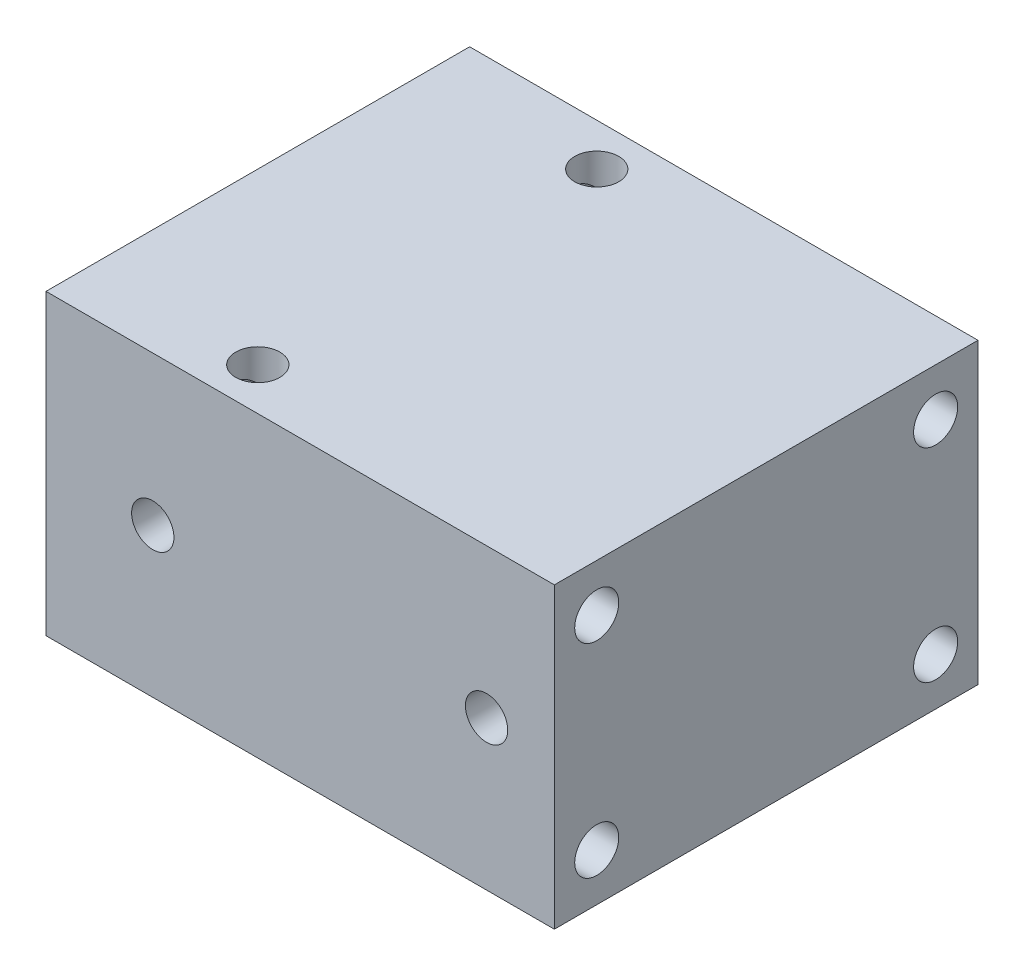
ISO-10303-21;
HEADER;
FILE_DESCRIPTION(('STEP AP214'),'2;1');
FILE_NAME('part.step','',(''),(''),'','','');
FILE_SCHEMA(('AUTOMOTIVE_DESIGN { 1 0 10303 214 1 1 1 1 }'));
ENDSEC;
DATA;
#1=APPLICATION_CONTEXT('core data for automotive mechanical design processes');
#2=APPLICATION_PROTOCOL_DEFINITION('international standard','automotive_design',2000,#1);
#3=PRODUCT_CONTEXT('',#1,'mechanical');
#4=PRODUCT('Part','Part','',(#3));
#5=PRODUCT_RELATED_PRODUCT_CATEGORY('part','',(#4));
#6=PRODUCT_DEFINITION_FORMATION('','',#4);
#7=PRODUCT_DEFINITION_CONTEXT('part definition',#1,'design');
#8=PRODUCT_DEFINITION('design','',#6,#7);
#9=PRODUCT_DEFINITION_SHAPE('','',#8);
#10=(LENGTH_UNIT() NAMED_UNIT(*) SI_UNIT(.MILLI.,.METRE.));
#11=(NAMED_UNIT(*) PLANE_ANGLE_UNIT() SI_UNIT($,.RADIAN.));
#12=(NAMED_UNIT(*) SI_UNIT($,.STERADIAN.) SOLID_ANGLE_UNIT());
#13=UNCERTAINTY_MEASURE_WITH_UNIT(LENGTH_MEASURE(1.E-05),#10,'distance_accuracy_value','');
#14=(GEOMETRIC_REPRESENTATION_CONTEXT(3) GLOBAL_UNCERTAINTY_ASSIGNED_CONTEXT((#13)) GLOBAL_UNIT_ASSIGNED_CONTEXT((#10,
#11,#12)) REPRESENTATION_CONTEXT('',''));
#15=CARTESIAN_POINT('',(0.,0.,0.));
#16=DIRECTION('',(0.,0.,1.));
#17=DIRECTION('',(1.,0.,0.));
#18=AXIS2_PLACEMENT_3D('',#15,#16,#17);
#19=CARTESIAN_POINT('',(-25.,88.,50.));
#20=DIRECTION('',(0.,-1.,0.));
#21=DIRECTION('',(0.,0.,-1.));
#22=AXIS2_PLACEMENT_3D('',#19,#20,#21);
#23=CYLINDRICAL_SURFACE('',#22,6.5);
#24=CARTESIAN_POINT('',(-25.,14.,50.));
#25=DIRECTION('',(-0.707106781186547,-0.707106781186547,0.));
#26=DIRECTION('',(0.707106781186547,-0.707106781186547,0.));
#27=AXIS2_PLACEMENT_3D('',#24,#25,#26);
#28=ELLIPSE('',#27,9.19238815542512,6.5);
#29=CARTESIAN_POINT('',(-25.,14.,43.5));
#30=VERTEX_POINT('',#29);
#31=CARTESIAN_POINT('',(-25.,14.,56.5));
#32=VERTEX_POINT('',#31);
#33=EDGE_CURVE('E11',#30,#32,#28,.F.);
#34=ORIENTED_EDGE('',*,*,#33,.F.);
#35=CARTESIAN_POINT('',(-25.,14.,50.));
#36=DIRECTION('',(0.707106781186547,-0.707106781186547,0.));
#37=DIRECTION('',(-0.707106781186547,-0.707106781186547,0.));
#38=AXIS2_PLACEMENT_3D('',#35,#36,#37);
#39=ELLIPSE('',#38,9.19238815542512,6.5);
#40=EDGE_CURVE('E51',#32,#30,#39,.F.);
#41=ORIENTED_EDGE('',*,*,#40,.F.);
#42=EDGE_LOOP('',(#34,#41));
#43=FACE_BOUND('',#42,.T.);
#44=CARTESIAN_POINT('',(-25.,74.,50.));
#45=DIRECTION('',(-0.707106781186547,-0.707106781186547,0.));
#46=DIRECTION('',(0.707106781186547,-0.707106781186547,0.));
#47=AXIS2_PLACEMENT_3D('',#44,#45,#46);
#48=ELLIPSE('',#47,9.19238815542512,6.5);
#49=CARTESIAN_POINT('',(-25.,74.,43.5));
#50=VERTEX_POINT('',#49);
#51=CARTESIAN_POINT('',(-25.,74.,56.5));
#52=VERTEX_POINT('',#51);
#53=EDGE_CURVE('E265',#50,#52,#48,.T.);
#54=ORIENTED_EDGE('',*,*,#53,.F.);
#55=CARTESIAN_POINT('',(-25.,74.,50.));
#56=DIRECTION('',(0.707106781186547,-0.707106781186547,0.));
#57=DIRECTION('',(-0.707106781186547,-0.707106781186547,0.));
#58=AXIS2_PLACEMENT_3D('',#55,#56,#57);
#59=ELLIPSE('',#58,9.19238815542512,6.5);
#60=EDGE_CURVE('E263',#52,#50,#59,.T.);
#61=ORIENTED_EDGE('',*,*,#60,.F.);
#62=EDGE_LOOP('',(#54,#61));
#63=FACE_BOUND('',#62,.T.);
#64=ADVANCED_FACE('F35',(#43,#63),#23,.F.);
#65=CARTESIAN_POINT('',(-25.,74.,50.));
#66=DIRECTION('',(-0.707106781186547,-0.707106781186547,0.));
#67=DIRECTION('',(0.707106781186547,-0.707106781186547,0.));
#68=AXIS2_PLACEMENT_3D('',#65,#66,#67);
#69=ELLIPSE('',#68,9.19238815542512,6.5);
#70=EDGE_CURVE('E118',#50,#52,#69,.F.);
#71=ORIENTED_EDGE('',*,*,#70,.F.);
#72=CARTESIAN_POINT('',(-25.,74.,50.));
#73=DIRECTION('',(0.707106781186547,-0.707106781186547,0.));
#74=DIRECTION('',(-0.707106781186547,-0.707106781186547,0.));
#75=AXIS2_PLACEMENT_3D('',#72,#73,#74);
#76=ELLIPSE('',#75,9.19238815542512,6.5);
#77=EDGE_CURVE('E58',#52,#50,#76,.F.);
#78=ORIENTED_EDGE('',*,*,#77,.F.);
#79=EDGE_LOOP('',(#71,#78));
#80=FACE_BOUND('',#79,.T.);
#81=CARTESIAN_POINT('',(-25.,88.,50.));
#82=DIRECTION('',(0.,1.,0.));
#83=DIRECTION('',(0.,0.,1.));
#84=AXIS2_PLACEMENT_3D('',#81,#82,#83);
#85=CIRCLE('',#84,6.5);
#86=CARTESIAN_POINT('',(-25.,88.,56.5));
#87=VERTEX_POINT('',#86);
#88=EDGE_CURVE('E199',#87,#87,#85,.T.);
#89=ORIENTED_EDGE('',*,*,#88,.T.);
#90=EDGE_LOOP('',(#89));
#91=FACE_BOUND('',#90,.T.);
#92=ADVANCED_FACE('F320',(#80,#91),#23,.F.);
#93=CARTESIAN_POINT('',(-25.,88.,-50.));
#94=DIRECTION('',(0.,-1.,0.));
#95=DIRECTION('',(0.,0.,-1.));
#96=AXIS2_PLACEMENT_3D('',#93,#94,#95);
#97=CYLINDRICAL_SURFACE('',#96,6.5);
#98=CARTESIAN_POINT('',(-25.,14.,-50.));
#99=DIRECTION('',(-0.707106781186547,-0.707106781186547,0.));
#100=DIRECTION('',(0.707106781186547,-0.707106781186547,0.));
#101=AXIS2_PLACEMENT_3D('',#98,#99,#100);
#102=ELLIPSE('',#101,9.19238815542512,6.5);
#103=CARTESIAN_POINT('',(-25.,14.,-56.5));
#104=VERTEX_POINT('',#103);
#105=CARTESIAN_POINT('',(-25.,14.,-43.5));
#106=VERTEX_POINT('',#105);
#107=EDGE_CURVE('E259',#104,#106,#102,.F.);
#108=ORIENTED_EDGE('',*,*,#107,.F.);
#109=CARTESIAN_POINT('',(-25.,14.,-50.));
#110=DIRECTION('',(0.707106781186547,-0.707106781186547,0.));
#111=DIRECTION('',(-0.707106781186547,-0.707106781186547,0.));
#112=AXIS2_PLACEMENT_3D('',#109,#110,#111);
#113=ELLIPSE('',#112,9.19238815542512,6.5);
#114=EDGE_CURVE('E251',#106,#104,#113,.F.);
#115=ORIENTED_EDGE('',*,*,#114,.F.);
#116=EDGE_LOOP('',(#108,#115));
#117=FACE_BOUND('',#116,.T.);
#118=CARTESIAN_POINT('',(-25.,74.,-50.));
#119=DIRECTION('',(-0.707106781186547,-0.707106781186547,0.));
#120=DIRECTION('',(0.707106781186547,-0.707106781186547,0.));
#121=AXIS2_PLACEMENT_3D('',#118,#119,#120);
#122=ELLIPSE('',#121,9.19238815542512,6.5);
#123=CARTESIAN_POINT('',(-25.,74.,-56.5));
#124=VERTEX_POINT('',#123);
#125=CARTESIAN_POINT('',(-25.,74.,-43.5));
#126=VERTEX_POINT('',#125);
#127=EDGE_CURVE('E245',#124,#126,#122,.T.);
#128=ORIENTED_EDGE('',*,*,#127,.F.);
#129=CARTESIAN_POINT('',(-25.,74.,-50.));
#130=DIRECTION('',(0.707106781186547,-0.707106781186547,0.));
#131=DIRECTION('',(-0.707106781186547,-0.707106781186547,0.));
#132=AXIS2_PLACEMENT_3D('',#129,#130,#131);
#133=ELLIPSE('',#132,9.19238815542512,6.5);
#134=EDGE_CURVE('E243',#126,#124,#133,.T.);
#135=ORIENTED_EDGE('',*,*,#134,.F.);
#136=EDGE_LOOP('',(#128,#135));
#137=FACE_BOUND('',#136,.T.);
#138=ADVANCED_FACE('F325',(#117,#137),#97,.F.);
#139=CARTESIAN_POINT('',(-25.,74.,-50.));
#140=DIRECTION('',(-0.707106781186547,-0.707106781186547,0.));
#141=DIRECTION('',(0.707106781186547,-0.707106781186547,0.));
#142=AXIS2_PLACEMENT_3D('',#139,#140,#141);
#143=ELLIPSE('',#142,9.19238815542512,6.5);
#144=EDGE_CURVE('E248',#124,#126,#143,.F.);
#145=ORIENTED_EDGE('',*,*,#144,.F.);
#146=CARTESIAN_POINT('',(-25.,74.,-50.));
#147=DIRECTION('',(0.707106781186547,-0.707106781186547,0.));
#148=DIRECTION('',(-0.707106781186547,-0.707106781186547,0.));
#149=AXIS2_PLACEMENT_3D('',#146,#147,#148);
#150=ELLIPSE('',#149,9.19238815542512,6.5);
#151=EDGE_CURVE('E240',#126,#124,#150,.F.);
#152=ORIENTED_EDGE('',*,*,#151,.F.);
#153=EDGE_LOOP('',(#145,#152));
#154=FACE_BOUND('',#153,.T.);
#155=CARTESIAN_POINT('',(-25.,88.,-50.));
#156=DIRECTION('',(0.,1.,0.));
#157=DIRECTION('',(0.,0.,1.));
#158=AXIS2_PLACEMENT_3D('',#155,#156,#157);
#159=CIRCLE('',#158,6.5);
#160=CARTESIAN_POINT('',(-25.,88.,-43.5));
#161=VERTEX_POINT('',#160);
#162=EDGE_CURVE('E205',#161,#161,#159,.T.);
#163=ORIENTED_EDGE('',*,*,#162,.T.);
#164=EDGE_LOOP('',(#163));
#165=FACE_BOUND('',#164,.T.);
#166=ADVANCED_FACE('F338',(#154,#165),#97,.F.);
#167=CARTESIAN_POINT('',(-75.,88.,62.5));
#168=DIRECTION('',(0.,1.,0.));
#169=DIRECTION('',(0.,0.,1.));
#170=AXIS2_PLACEMENT_3D('',#167,#168,#169);
#171=PLANE('',#170);
#172=ORIENTED_EDGE('',*,*,#162,.F.);
#173=EDGE_LOOP('',(#172));
#174=FACE_BOUND('',#173,.T.);
#175=DIRECTION('',(0.,0.,1.));
#176=VECTOR('',#175,1.);
#177=CARTESIAN_POINT('',(-75.,88.,-62.5));
#178=LINE('',#177,#176);
#179=CARTESIAN_POINT('',(-75.,88.,-62.5));
#180=VERTEX_POINT('',#179);
#181=CARTESIAN_POINT('',(-75.,88.,62.5));
#182=VERTEX_POINT('',#181);
#183=EDGE_CURVE('E211',#180,#182,#178,.T.);
#184=ORIENTED_EDGE('',*,*,#183,.T.);
#185=DIRECTION('',(1.,0.,0.));
#186=VECTOR('',#185,1.);
#187=CARTESIAN_POINT('',(-75.,88.,62.5));
#188=LINE('',#187,#186);
#189=CARTESIAN_POINT('',(75.,88.,62.5));
#190=VERTEX_POINT('',#189);
#191=EDGE_CURVE('E214',#182,#190,#188,.T.);
#192=ORIENTED_EDGE('',*,*,#191,.T.);
#193=DIRECTION('',(0.,0.,-1.));
#194=VECTOR('',#193,1.);
#195=CARTESIAN_POINT('',(75.,88.,-62.5));
#196=LINE('',#195,#194);
#197=CARTESIAN_POINT('',(75.,88.,-62.5));
#198=VERTEX_POINT('',#197);
#199=EDGE_CURVE('E217',#190,#198,#196,.T.);
#200=ORIENTED_EDGE('',*,*,#199,.T.);
#201=DIRECTION('',(-1.,0.,0.));
#202=VECTOR('',#201,1.);
#203=CARTESIAN_POINT('',(-75.,88.,-62.5));
#204=LINE('',#203,#202);
#205=EDGE_CURVE('E219',#198,#180,#204,.T.);
#206=ORIENTED_EDGE('',*,*,#205,.T.);
#207=EDGE_LOOP('',(#184,#192,#200,#206));
#208=FACE_BOUND('',#207,.T.);
#209=ORIENTED_EDGE('',*,*,#88,.F.);
#210=EDGE_LOOP('',(#209));
#211=FACE_BOUND('',#210,.T.);
#212=ADVANCED_FACE('F308',(#174,#208,#211),#171,.T.);
#213=CARTESIAN_POINT('',(-75.,0.,62.5));
#214=DIRECTION('',(0.,1.,0.));
#215=DIRECTION('',(0.,0.,1.));
#216=AXIS2_PLACEMENT_3D('',#213,#214,#215);
#217=PLANE('',#216);
#218=CARTESIAN_POINT('',(-25.,0.,-50.));
#219=DIRECTION('',(0.,1.,0.));
#220=DIRECTION('',(0.,0.,1.));
#221=AXIS2_PLACEMENT_3D('',#218,#219,#220);
#222=CIRCLE('',#221,6.5);
#223=CARTESIAN_POINT('',(-25.,0.,-43.5));
#224=VERTEX_POINT('',#223);
#225=EDGE_CURVE('E202',#224,#224,#222,.T.);
#226=ORIENTED_EDGE('',*,*,#225,.T.);
#227=EDGE_LOOP('',(#226));
#228=FACE_BOUND('',#227,.T.);
#229=DIRECTION('',(0.,0.,1.));
#230=VECTOR('',#229,1.);
#231=CARTESIAN_POINT('',(-75.,0.,-62.5));
#232=LINE('',#231,#230);
#233=CARTESIAN_POINT('',(-75.,0.,-62.5));
#234=VERTEX_POINT('',#233);
#235=CARTESIAN_POINT('',(-75.,0.,62.5));
#236=VERTEX_POINT('',#235);
#237=EDGE_CURVE('E208',#234,#236,#232,.T.);
#238=ORIENTED_EDGE('',*,*,#237,.F.);
#239=DIRECTION('',(-1.,0.,0.));
#240=VECTOR('',#239,1.);
#241=CARTESIAN_POINT('',(-75.,0.,-62.5));
#242=LINE('',#241,#240);
#243=CARTESIAN_POINT('',(75.,0.,-62.5));
#244=VERTEX_POINT('',#243);
#245=EDGE_CURVE('E215',#244,#234,#242,.T.);
#246=ORIENTED_EDGE('',*,*,#245,.F.);
#247=DIRECTION('',(0.,0.,-1.));
#248=VECTOR('',#247,1.);
#249=CARTESIAN_POINT('',(75.,0.,-62.5));
#250=LINE('',#249,#248);
#251=CARTESIAN_POINT('',(75.,0.,62.5));
#252=VERTEX_POINT('',#251);
#253=EDGE_CURVE('E226',#252,#244,#250,.T.);
#254=ORIENTED_EDGE('',*,*,#253,.F.);
#255=DIRECTION('',(1.,0.,0.));
#256=VECTOR('',#255,1.);
#257=CARTESIAN_POINT('',(-75.,0.,62.5));
#258=LINE('',#257,#256);
#259=EDGE_CURVE('E224',#236,#252,#258,.T.);
#260=ORIENTED_EDGE('',*,*,#259,.F.);
#261=EDGE_LOOP('',(#238,#246,#254,#260));
#262=FACE_BOUND('',#261,.T.);
#263=CARTESIAN_POINT('',(-25.,0.,50.));
#264=DIRECTION('',(0.,1.,0.));
#265=DIRECTION('',(0.,0.,1.));
#266=AXIS2_PLACEMENT_3D('',#263,#264,#265);
#267=CIRCLE('',#266,6.5);
#268=CARTESIAN_POINT('',(-25.,0.,56.5));
#269=VERTEX_POINT('',#268);
#270=EDGE_CURVE('E196',#269,#269,#267,.T.);
#271=ORIENTED_EDGE('',*,*,#270,.T.);
#272=EDGE_LOOP('',(#271));
#273=FACE_BOUND('',#272,.T.);
#274=ADVANCED_FACE('F302',(#228,#262,#273),#217,.F.);
#275=CARTESIAN_POINT('',(-75.,88.,-62.5));
#276=DIRECTION('',(1.,0.,0.));
#277=DIRECTION('',(0.,0.,-1.));
#278=AXIS2_PLACEMENT_3D('',#275,#276,#277);
#279=PLANE('',#278);
#280=CARTESIAN_POINT('',(-75.,14.,50.));
#281=DIRECTION('',(-1.,0.,0.));
#282=DIRECTION('',(0.,0.,1.));
#283=AXIS2_PLACEMENT_3D('',#280,#281,#282);
#284=CIRCLE('',#283,6.5);
#285=CARTESIAN_POINT('',(-75.,14.,56.5));
#286=VERTEX_POINT('',#285);
#287=EDGE_CURVE('E131',#286,#286,#284,.T.);
#288=ORIENTED_EDGE('',*,*,#287,.F.);
#289=EDGE_LOOP('',(#288));
#290=FACE_BOUND('',#289,.T.);
#291=CARTESIAN_POINT('',(-75.,74.,50.));
#292=DIRECTION('',(-1.,0.,0.));
#293=DIRECTION('',(0.,0.,1.));
#294=AXIS2_PLACEMENT_3D('',#291,#292,#293);
#295=CIRCLE('',#294,6.5);
#296=CARTESIAN_POINT('',(-75.,74.,56.5));
#297=VERTEX_POINT('',#296);
#298=EDGE_CURVE('E150',#297,#297,#295,.T.);
#299=ORIENTED_EDGE('',*,*,#298,.F.);
#300=EDGE_LOOP('',(#299));
#301=FACE_BOUND('',#300,.T.);
#302=CARTESIAN_POINT('',(-75.,14.,-50.));
#303=DIRECTION('',(-1.,0.,0.));
#304=DIRECTION('',(0.,0.,1.));
#305=AXIS2_PLACEMENT_3D('',#302,#303,#304);
#306=CIRCLE('',#305,6.5);
#307=CARTESIAN_POINT('',(-75.,14.,-43.5));
#308=VERTEX_POINT('',#307);
#309=EDGE_CURVE('E156',#308,#308,#306,.T.);
#310=ORIENTED_EDGE('',*,*,#309,.F.);
#311=EDGE_LOOP('',(#310));
#312=FACE_BOUND('',#311,.T.);
#313=CARTESIAN_POINT('',(-75.,74.,-50.));
#314=DIRECTION('',(-1.,0.,0.));
#315=DIRECTION('',(0.,0.,1.));
#316=AXIS2_PLACEMENT_3D('',#313,#314,#315);
#317=CIRCLE('',#316,6.5);
#318=CARTESIAN_POINT('',(-75.,74.,-43.5));
#319=VERTEX_POINT('',#318);
#320=EDGE_CURVE('E162',#319,#319,#317,.T.);
#321=ORIENTED_EDGE('',*,*,#320,.F.);
#322=EDGE_LOOP('',(#321));
#323=FACE_BOUND('',#322,.T.);
#324=CARTESIAN_POINT('',(-75.,44.,0.));
#325=DIRECTION('',(-1.,0.,0.));
#326=DIRECTION('',(0.,0.,1.));
#327=AXIS2_PLACEMENT_3D('',#324,#325,#326);
#328=CIRCLE('',#327,1.5);
#329=CARTESIAN_POINT('',(-75.,44.,1.5));
#330=VERTEX_POINT('',#329);
#331=EDGE_CURVE('E192',#330,#330,#328,.T.);
#332=ORIENTED_EDGE('',*,*,#331,.F.);
#333=EDGE_LOOP('',(#332));
#334=FACE_BOUND('',#333,.T.);
#335=ORIENTED_EDGE('',*,*,#237,.T.);
#336=DIRECTION('',(0.,-1.,0.));
#337=VECTOR('',#336,1.);
#338=CARTESIAN_POINT('',(-75.,88.,62.5));
#339=LINE('',#338,#337);
#340=EDGE_CURVE('E237',#182,#236,#339,.T.);
#341=ORIENTED_EDGE('',*,*,#340,.F.);
#342=ORIENTED_EDGE('',*,*,#183,.F.);
#343=DIRECTION('',(0.,-1.,0.));
#344=VECTOR('',#343,1.);
#345=CARTESIAN_POINT('',(-75.,88.,-62.5));
#346=LINE('',#345,#344);
#347=EDGE_CURVE('E221',#180,#234,#346,.T.);
#348=ORIENTED_EDGE('',*,*,#347,.T.);
#349=EDGE_LOOP('',(#335,#341,#342,#348));
#350=FACE_BOUND('',#349,.T.);
#351=ADVANCED_FACE('F37',(#290,#301,#312,#323,#334,#350),#279,.F.);
#352=CARTESIAN_POINT('',(-75.,88.,62.5));
#353=DIRECTION('',(0.,0.,-1.));
#354=DIRECTION('',(-1.,0.,0.));
#355=AXIS2_PLACEMENT_3D('',#352,#353,#354);
#356=PLANE('',#355);
#357=CARTESIAN_POINT('',(55.,44.,62.5));
#358=DIRECTION('',(0.,0.,1.));
#359=DIRECTION('',(1.,0.,0.));
#360=AXIS2_PLACEMENT_3D('',#357,#358,#359);
#361=CIRCLE('',#360,6.2436883);
#362=CARTESIAN_POINT('',(61.2436883,44.,62.5));
#363=VERTEX_POINT('',#362);
#364=EDGE_CURVE('E168',#363,#363,#361,.T.);
#365=ORIENTED_EDGE('',*,*,#364,.F.);
#366=EDGE_LOOP('',(#365));
#367=FACE_BOUND('',#366,.T.);
#368=CARTESIAN_POINT('',(-43.5,44.,62.5));
#369=DIRECTION('',(0.,0.,1.));
#370=DIRECTION('',(1.,0.,0.));
#371=AXIS2_PLACEMENT_3D('',#368,#369,#370);
#372=CIRCLE('',#371,6.2436883);
#373=CARTESIAN_POINT('',(-37.2563117,44.,62.5));
#374=VERTEX_POINT('',#373);
#375=EDGE_CURVE('E180',#374,#374,#372,.T.);
#376=ORIENTED_EDGE('',*,*,#375,.F.);
#377=EDGE_LOOP('',(#376));
#378=FACE_BOUND('',#377,.T.);
#379=ORIENTED_EDGE('',*,*,#259,.T.);
#380=DIRECTION('',(0.,-1.,0.));
#381=VECTOR('',#380,1.);
#382=CARTESIAN_POINT('',(75.,88.,62.5));
#383=LINE('',#382,#381);
#384=EDGE_CURVE('E234',#190,#252,#383,.T.);
#385=ORIENTED_EDGE('',*,*,#384,.F.);
#386=ORIENTED_EDGE('',*,*,#191,.F.);
#387=ORIENTED_EDGE('',*,*,#340,.T.);
#388=EDGE_LOOP('',(#379,#385,#386,#387));
#389=FACE_BOUND('',#388,.T.);
#390=ADVANCED_FACE('F285',(#367,#378,#389),#356,.F.);
#391=CARTESIAN_POINT('',(75.,88.,-62.5));
#392=DIRECTION('',(-1.,0.,0.));
#393=DIRECTION('',(0.,0.,1.));
#394=AXIS2_PLACEMENT_3D('',#391,#392,#393);
#395=PLANE('',#394);
#396=CARTESIAN_POINT('',(75.,14.,50.));
#397=DIRECTION('',(-1.,0.,0.));
#398=DIRECTION('',(0.,0.,1.));
#399=AXIS2_PLACEMENT_3D('',#396,#397,#398);
#400=CIRCLE('',#399,6.5);
#401=CARTESIAN_POINT('',(75.,14.,56.5));
#402=VERTEX_POINT('',#401);
#403=EDGE_CURVE('E147',#402,#402,#400,.F.);
#404=ORIENTED_EDGE('',*,*,#403,.F.);
#405=EDGE_LOOP('',(#404));
#406=FACE_BOUND('',#405,.T.);
#407=CARTESIAN_POINT('',(75.,74.,50.));
#408=DIRECTION('',(-1.,0.,0.));
#409=DIRECTION('',(0.,0.,1.));
#410=AXIS2_PLACEMENT_3D('',#407,#408,#409);
#411=CIRCLE('',#410,6.5);
#412=CARTESIAN_POINT('',(75.,74.,56.5));
#413=VERTEX_POINT('',#412);
#414=EDGE_CURVE('E153',#413,#413,#411,.F.);
#415=ORIENTED_EDGE('',*,*,#414,.F.);
#416=EDGE_LOOP('',(#415));
#417=FACE_BOUND('',#416,.T.);
#418=CARTESIAN_POINT('',(75.,14.,-50.));
#419=DIRECTION('',(-1.,0.,0.));
#420=DIRECTION('',(0.,0.,1.));
#421=AXIS2_PLACEMENT_3D('',#418,#419,#420);
#422=CIRCLE('',#421,6.5);
#423=CARTESIAN_POINT('',(75.,14.,-43.5));
#424=VERTEX_POINT('',#423);
#425=EDGE_CURVE('E159',#424,#424,#422,.F.);
#426=ORIENTED_EDGE('',*,*,#425,.F.);
#427=EDGE_LOOP('',(#426));
#428=FACE_BOUND('',#427,.T.);
#429=CARTESIAN_POINT('',(75.,74.,-50.));
#430=DIRECTION('',(-1.,0.,0.));
#431=DIRECTION('',(0.,0.,1.));
#432=AXIS2_PLACEMENT_3D('',#429,#430,#431);
#433=CIRCLE('',#432,6.5);
#434=CARTESIAN_POINT('',(75.,74.,-43.5));
#435=VERTEX_POINT('',#434);
#436=EDGE_CURVE('E165',#435,#435,#433,.F.);
#437=ORIENTED_EDGE('',*,*,#436,.F.);
#438=EDGE_LOOP('',(#437));
#439=FACE_BOUND('',#438,.T.);
#440=ORIENTED_EDGE('',*,*,#253,.T.);
#441=DIRECTION('',(0.,-1.,0.));
#442=VECTOR('',#441,1.);
#443=CARTESIAN_POINT('',(75.,88.,-62.5));
#444=LINE('',#443,#442);
#445=EDGE_CURVE('E231',#198,#244,#444,.T.);
#446=ORIENTED_EDGE('',*,*,#445,.F.);
#447=ORIENTED_EDGE('',*,*,#199,.F.);
#448=ORIENTED_EDGE('',*,*,#384,.T.);
#449=EDGE_LOOP('',(#440,#446,#447,#448));
#450=FACE_BOUND('',#449,.T.);
#451=ADVANCED_FACE('F281',(#406,#417,#428,#439,#450),#395,.F.);
#452=CARTESIAN_POINT('',(-75.,88.,-62.5));
#453=DIRECTION('',(0.,0.,1.));
#454=DIRECTION('',(1.,0.,0.));
#455=AXIS2_PLACEMENT_3D('',#452,#453,#454);
#456=PLANE('',#455);
#457=ORIENTED_EDGE('',*,*,#245,.T.);
#458=ORIENTED_EDGE('',*,*,#347,.F.);
#459=ORIENTED_EDGE('',*,*,#205,.F.);
#460=ORIENTED_EDGE('',*,*,#445,.T.);
#461=EDGE_LOOP('',(#457,#458,#459,#460));
#462=FACE_BOUND('',#461,.T.);
#463=ADVANCED_FACE('F284',(#462),#456,.F.);
#464=CARTESIAN_POINT('',(-25.,14.,-50.));
#465=DIRECTION('',(-0.707106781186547,-0.707106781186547,0.));
#466=DIRECTION('',(0.707106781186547,-0.707106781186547,0.));
#467=AXIS2_PLACEMENT_3D('',#464,#465,#466);
#468=ELLIPSE('',#467,9.19238815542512,6.5);
#469=EDGE_CURVE('E256',#104,#106,#468,.T.);
#470=ORIENTED_EDGE('',*,*,#469,.F.);
#471=CARTESIAN_POINT('',(-25.,14.,-50.));
#472=DIRECTION('',(0.707106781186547,-0.707106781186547,0.));
#473=DIRECTION('',(-0.707106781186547,-0.707106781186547,0.));
#474=AXIS2_PLACEMENT_3D('',#471,#472,#473);
#475=ELLIPSE('',#474,9.19238815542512,6.5);
#476=EDGE_CURVE('E254',#106,#104,#475,.T.);
#477=ORIENTED_EDGE('',*,*,#476,.F.);
#478=EDGE_LOOP('',(#470,#477));
#479=FACE_BOUND('',#478,.T.);
#480=ORIENTED_EDGE('',*,*,#225,.F.);
#481=EDGE_LOOP('',(#480));
#482=FACE_BOUND('',#481,.T.);
#483=ADVANCED_FACE('F330',(#479,#482),#97,.F.);
#484=CARTESIAN_POINT('',(-25.,14.,50.));
#485=DIRECTION('',(-0.707106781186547,-0.707106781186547,0.));
#486=DIRECTION('',(0.707106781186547,-0.707106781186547,0.));
#487=AXIS2_PLACEMENT_3D('',#484,#485,#486);
#488=ELLIPSE('',#487,9.19238815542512,6.5);
#489=EDGE_CURVE('E44',#30,#32,#488,.T.);
#490=ORIENTED_EDGE('',*,*,#489,.F.);
#491=CARTESIAN_POINT('',(-25.,14.,50.));
#492=DIRECTION('',(0.707106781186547,-0.707106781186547,0.));
#493=DIRECTION('',(-0.707106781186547,-0.707106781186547,0.));
#494=AXIS2_PLACEMENT_3D('',#491,#492,#493);
#495=ELLIPSE('',#494,9.19238815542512,6.5);
#496=EDGE_CURVE('E109',#32,#30,#495,.T.);
#497=ORIENTED_EDGE('',*,*,#496,.F.);
#498=EDGE_LOOP('',(#490,#497));
#499=FACE_BOUND('',#498,.T.);
#500=ORIENTED_EDGE('',*,*,#270,.F.);
#501=EDGE_LOOP('',(#500));
#502=FACE_BOUND('',#501,.T.);
#503=ADVANCED_FACE('F121',(#499,#502),#23,.F.);
#504=CARTESIAN_POINT('',(-15.,44.,0.));
#505=DIRECTION('',(-1.,0.,0.));
#506=DIRECTION('',(0.,0.,1.));
#507=AXIS2_PLACEMENT_3D('',#504,#505,#506);
#508=CYLINDRICAL_SURFACE('',#507,1.5);
#509=CARTESIAN_POINT('',(-15.,44.,0.));
#510=DIRECTION('',(-1.,0.,0.));
#511=DIRECTION('',(0.,0.,1.));
#512=AXIS2_PLACEMENT_3D('',#509,#510,#511);
#513=CIRCLE('',#512,1.5);
#514=CARTESIAN_POINT('',(-15.,44.,1.49999999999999));
#515=VERTEX_POINT('',#514);
#516=EDGE_CURVE('E193',#515,#515,#513,.T.);
#517=ORIENTED_EDGE('',*,*,#516,.F.);
#518=EDGE_LOOP('',(#517));
#519=FACE_BOUND('',#518,.T.);
#520=ORIENTED_EDGE('',*,*,#331,.T.);
#521=EDGE_LOOP('',(#520));
#522=FACE_BOUND('',#521,.T.);
#523=ADVANCED_FACE('F329',(#519,#522),#508,.F.);
#524=CARTESIAN_POINT('',(-15.,44.,0.));
#525=DIRECTION('',(-1.,0.,0.));
#526=DIRECTION('',(0.,0.,1.));
#527=AXIS2_PLACEMENT_3D('',#524,#525,#526);
#528=PLANE('',#527);
#529=ORIENTED_EDGE('',*,*,#516,.T.);
#530=EDGE_LOOP('',(#529));
#531=FACE_BOUND('',#530,.T.);
#532=ADVANCED_FACE('F335',(#531),#528,.T.);
#533=CARTESIAN_POINT('',(-43.5,44.,45.43));
#534=DIRECTION('',(0.,0.,1.));
#535=DIRECTION('',(1.,0.,0.));
#536=AXIS2_PLACEMENT_3D('',#533,#534,#535);
#537=CONICAL_SURFACE('',#536,5.5626,1.02974425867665);
#538=CARTESIAN_POINT('',(-43.5,44.,43.2893739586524));
#539=DIRECTION('',(0.,0.,1.));
#540=DIRECTION('',(1.,0.,0.));
#541=AXIS2_PLACEMENT_3D('',#538,#539,#540);
#542=CIRCLE('',#541,2.00000000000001);
#543=CARTESIAN_POINT('',(-41.5,44.,43.2893739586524));
#544=VERTEX_POINT('',#543);
#545=EDGE_CURVE('E128',#544,#544,#542,.F.);
#546=ORIENTED_EDGE('',*,*,#545,.T.);
#547=EDGE_LOOP('',(#546));
#548=FACE_BOUND('',#547,.T.);
#549=CARTESIAN_POINT('',(-43.5,44.,45.43));
#550=DIRECTION('',(0.,0.,1.));
#551=DIRECTION('',(1.,0.,0.));
#552=AXIS2_PLACEMENT_3D('',#549,#550,#551);
#553=CIRCLE('',#552,5.5626);
#554=CARTESIAN_POINT('',(-37.9374,44.,45.43));
#555=VERTEX_POINT('',#554);
#556=EDGE_CURVE('E189',#555,#555,#553,.T.);
#557=ORIENTED_EDGE('',*,*,#556,.T.);
#558=EDGE_LOOP('',(#557));
#559=FACE_BOUND('',#558,.T.);
#560=ADVANCED_FACE('F401',(#548,#559),#537,.F.);
#561=CARTESIAN_POINT('',(-43.5,44.,62.5));
#562=DIRECTION('',(0.,0.,1.));
#563=DIRECTION('',(1.,0.,0.));
#564=AXIS2_PLACEMENT_3D('',#561,#562,#563);
#565=CYLINDRICAL_SURFACE('',#564,5.5626);
#566=ORIENTED_EDGE('',*,*,#556,.F.);
#567=EDGE_LOOP('',(#566));
#568=FACE_BOUND('',#567,.T.);
#569=CARTESIAN_POINT('',(-43.5,44.,52.48));
#570=DIRECTION('',(0.,0.,1.));
#571=DIRECTION('',(1.,0.,0.));
#572=AXIS2_PLACEMENT_3D('',#569,#570,#571);
#573=CIRCLE('',#572,5.5626);
#574=CARTESIAN_POINT('',(-37.9374,44.,52.48));
#575=VERTEX_POINT('',#574);
#576=EDGE_CURVE('E186',#575,#575,#573,.T.);
#577=ORIENTED_EDGE('',*,*,#576,.T.);
#578=EDGE_LOOP('',(#577));
#579=FACE_BOUND('',#578,.T.);
#580=ADVANCED_FACE('F397',(#568,#579),#565,.F.);
#581=CARTESIAN_POINT('',(-37.9374,44.,52.48));
#582=DIRECTION('',(0.,0.,-1.));
#583=DIRECTION('',(-1.,0.,0.));
#584=AXIS2_PLACEMENT_3D('',#581,#582,#583);
#585=PLANE('',#584);
#586=ORIENTED_EDGE('',*,*,#576,.F.);
#587=EDGE_LOOP('',(#586));
#588=FACE_BOUND('',#587,.T.);
#589=CARTESIAN_POINT('',(-43.5,44.,52.48));
#590=DIRECTION('',(0.,0.,1.));
#591=DIRECTION('',(1.,0.,0.));
#592=AXIS2_PLACEMENT_3D('',#589,#590,#591);
#593=CIRCLE('',#592,5.94367608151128);
#594=CARTESIAN_POINT('',(-37.5563239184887,44.,52.48));
#595=VERTEX_POINT('',#594);
#596=EDGE_CURVE('E183',#595,#595,#593,.T.);
#597=ORIENTED_EDGE('',*,*,#596,.T.);
#598=EDGE_LOOP('',(#597));
#599=FACE_BOUND('',#598,.T.);
#600=ADVANCED_FACE('F393',(#588,#599),#585,.F.);
#601=CARTESIAN_POINT('',(-43.5,44.,62.5));
#602=DIRECTION('',(0.,0.,1.));
#603=DIRECTION('',(1.,0.,0.));
#604=AXIS2_PLACEMENT_3D('',#601,#602,#603);
#605=CONICAL_SURFACE('',#604,6.2436883,0.0299323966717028);
#606=ORIENTED_EDGE('',*,*,#596,.F.);
#607=EDGE_LOOP('',(#606));
#608=FACE_BOUND('',#607,.T.);
#609=ORIENTED_EDGE('',*,*,#375,.T.);
#610=EDGE_LOOP('',(#609));
#611=FACE_BOUND('',#610,.T.);
#612=ADVANCED_FACE('F388',(#608,#611),#605,.F.);
#613=CARTESIAN_POINT('',(55.,44.,45.43));
#614=DIRECTION('',(0.,0.,1.));
#615=DIRECTION('',(1.,0.,0.));
#616=AXIS2_PLACEMENT_3D('',#613,#614,#615);
#617=CONICAL_SURFACE('',#616,5.5626,1.02974425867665);
#618=CARTESIAN_POINT('',(55.,44.,43.2893739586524));
#619=DIRECTION('',(0.,0.,1.));
#620=DIRECTION('',(1.,0.,0.));
#621=AXIS2_PLACEMENT_3D('',#618,#619,#620);
#622=CIRCLE('',#621,2.);
#623=CARTESIAN_POINT('',(57.,44.,43.2893739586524));
#624=VERTEX_POINT('',#623);
#625=EDGE_CURVE('E39',#624,#624,#622,.F.);
#626=ORIENTED_EDGE('',*,*,#625,.T.);
#627=EDGE_LOOP('',(#626));
#628=FACE_BOUND('',#627,.T.);
#629=CARTESIAN_POINT('',(55.,44.,45.43));
#630=DIRECTION('',(0.,0.,1.));
#631=DIRECTION('',(1.,0.,0.));
#632=AXIS2_PLACEMENT_3D('',#629,#630,#631);
#633=CIRCLE('',#632,5.5626);
#634=CARTESIAN_POINT('',(60.5626,44.,45.43));
#635=VERTEX_POINT('',#634);
#636=EDGE_CURVE('E177',#635,#635,#633,.T.);
#637=ORIENTED_EDGE('',*,*,#636,.T.);
#638=EDGE_LOOP('',(#637));
#639=FACE_BOUND('',#638,.T.);
#640=ADVANCED_FACE('F384',(#628,#639),#617,.F.);
#641=CARTESIAN_POINT('',(55.,44.,62.5));
#642=DIRECTION('',(0.,0.,1.));
#643=DIRECTION('',(1.,0.,0.));
#644=AXIS2_PLACEMENT_3D('',#641,#642,#643);
#645=CYLINDRICAL_SURFACE('',#644,5.5626);
#646=ORIENTED_EDGE('',*,*,#636,.F.);
#647=EDGE_LOOP('',(#646));
#648=FACE_BOUND('',#647,.T.);
#649=CARTESIAN_POINT('',(55.,44.,52.48));
#650=DIRECTION('',(0.,0.,1.));
#651=DIRECTION('',(1.,0.,0.));
#652=AXIS2_PLACEMENT_3D('',#649,#650,#651);
#653=CIRCLE('',#652,5.5626);
#654=CARTESIAN_POINT('',(60.5626,44.,52.48));
#655=VERTEX_POINT('',#654);
#656=EDGE_CURVE('E174',#655,#655,#653,.T.);
#657=ORIENTED_EDGE('',*,*,#656,.T.);
#658=EDGE_LOOP('',(#657));
#659=FACE_BOUND('',#658,.T.);
#660=ADVANCED_FACE('F380',(#648,#659),#645,.F.);
#661=CARTESIAN_POINT('',(60.5626,44.,52.48));
#662=DIRECTION('',(0.,0.,-1.));
#663=DIRECTION('',(-1.,0.,0.));
#664=AXIS2_PLACEMENT_3D('',#661,#662,#663);
#665=PLANE('',#664);
#666=ORIENTED_EDGE('',*,*,#656,.F.);
#667=EDGE_LOOP('',(#666));
#668=FACE_BOUND('',#667,.T.);
#669=CARTESIAN_POINT('',(55.,44.,52.48));
#670=DIRECTION('',(0.,0.,1.));
#671=DIRECTION('',(1.,0.,0.));
#672=AXIS2_PLACEMENT_3D('',#669,#670,#671);
#673=CIRCLE('',#672,5.94367608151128);
#674=CARTESIAN_POINT('',(60.9436760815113,44.,52.48));
#675=VERTEX_POINT('',#674);
#676=EDGE_CURVE('E171',#675,#675,#673,.T.);
#677=ORIENTED_EDGE('',*,*,#676,.T.);
#678=EDGE_LOOP('',(#677));
#679=FACE_BOUND('',#678,.T.);
#680=ADVANCED_FACE('F373',(#668,#679),#665,.F.);
#681=CARTESIAN_POINT('',(55.,44.,62.5));
#682=DIRECTION('',(0.,0.,1.));
#683=DIRECTION('',(1.,0.,0.));
#684=AXIS2_PLACEMENT_3D('',#681,#682,#683);
#685=CONICAL_SURFACE('',#684,6.2436883,0.0299323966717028);
#686=ORIENTED_EDGE('',*,*,#676,.F.);
#687=EDGE_LOOP('',(#686));
#688=FACE_BOUND('',#687,.T.);
#689=ORIENTED_EDGE('',*,*,#364,.T.);
#690=EDGE_LOOP('',(#689));
#691=FACE_BOUND('',#690,.T.);
#692=ADVANCED_FACE('F366',(#688,#691),#685,.F.);
#693=CARTESIAN_POINT('',(93.3847763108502,74.,-50.));
#694=DIRECTION('',(-1.,0.,0.));
#695=DIRECTION('',(0.,0.,1.));
#696=AXIS2_PLACEMENT_3D('',#693,#694,#695);
#697=CYLINDRICAL_SURFACE('',#696,6.5);
#698=ORIENTED_EDGE('',*,*,#127,.T.);
#699=ORIENTED_EDGE('',*,*,#151,.T.);
#700=EDGE_LOOP('',(#698,#699));
#701=FACE_BOUND('',#700,.T.);
#702=ORIENTED_EDGE('',*,*,#436,.T.);
#703=EDGE_LOOP('',(#702));
#704=FACE_BOUND('',#703,.T.);
#705=ADVANCED_FACE('F362',(#701,#704),#697,.F.);
#706=ORIENTED_EDGE('',*,*,#144,.T.);
#707=ORIENTED_EDGE('',*,*,#134,.T.);
#708=EDGE_LOOP('',(#706,#707));
#709=FACE_BOUND('',#708,.T.);
#710=ORIENTED_EDGE('',*,*,#320,.T.);
#711=EDGE_LOOP('',(#710));
#712=FACE_BOUND('',#711,.T.);
#713=ADVANCED_FACE('F365',(#709,#712),#697,.F.);
#714=CARTESIAN_POINT('',(93.3847763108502,14.,-50.));
#715=DIRECTION('',(-1.,0.,0.));
#716=DIRECTION('',(0.,0.,1.));
#717=AXIS2_PLACEMENT_3D('',#714,#715,#716);
#718=CYLINDRICAL_SURFACE('',#717,6.5);
#719=ORIENTED_EDGE('',*,*,#469,.T.);
#720=ORIENTED_EDGE('',*,*,#114,.T.);
#721=EDGE_LOOP('',(#719,#720));
#722=FACE_BOUND('',#721,.T.);
#723=ORIENTED_EDGE('',*,*,#425,.T.);
#724=EDGE_LOOP('',(#723));
#725=FACE_BOUND('',#724,.T.);
#726=ADVANCED_FACE('F372',(#722,#725),#718,.F.);
#727=ORIENTED_EDGE('',*,*,#107,.T.);
#728=ORIENTED_EDGE('',*,*,#476,.T.);
#729=EDGE_LOOP('',(#727,#728));
#730=FACE_BOUND('',#729,.T.);
#731=ORIENTED_EDGE('',*,*,#309,.T.);
#732=EDGE_LOOP('',(#731));
#733=FACE_BOUND('',#732,.T.);
#734=ADVANCED_FACE('F277',(#730,#733),#718,.F.);
#735=CARTESIAN_POINT('',(93.3847763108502,74.,50.));
#736=DIRECTION('',(-1.,0.,0.));
#737=DIRECTION('',(0.,0.,1.));
#738=AXIS2_PLACEMENT_3D('',#735,#736,#737);
#739=CYLINDRICAL_SURFACE('',#738,6.5);
#740=ORIENTED_EDGE('',*,*,#53,.T.);
#741=ORIENTED_EDGE('',*,*,#77,.T.);
#742=EDGE_LOOP('',(#740,#741));
#743=FACE_BOUND('',#742,.T.);
#744=ORIENTED_EDGE('',*,*,#414,.T.);
#745=EDGE_LOOP('',(#744));
#746=FACE_BOUND('',#745,.T.);
#747=ADVANCED_FACE('F274',(#743,#746),#739,.F.);
#748=ORIENTED_EDGE('',*,*,#70,.T.);
#749=ORIENTED_EDGE('',*,*,#60,.T.);
#750=EDGE_LOOP('',(#748,#749));
#751=FACE_BOUND('',#750,.T.);
#752=ORIENTED_EDGE('',*,*,#298,.T.);
#753=EDGE_LOOP('',(#752));
#754=FACE_BOUND('',#753,.T.);
#755=ADVANCED_FACE('F270',(#751,#754),#739,.F.);
#756=CARTESIAN_POINT('',(93.3847763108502,14.,50.));
#757=DIRECTION('',(-1.,0.,0.));
#758=DIRECTION('',(0.,0.,1.));
#759=AXIS2_PLACEMENT_3D('',#756,#757,#758);
#760=CYLINDRICAL_SURFACE('',#759,6.5);
#761=ORIENTED_EDGE('',*,*,#489,.T.);
#762=ORIENTED_EDGE('',*,*,#40,.T.);
#763=EDGE_LOOP('',(#761,#762));
#764=FACE_BOUND('',#763,.T.);
#765=ORIENTED_EDGE('',*,*,#403,.T.);
#766=EDGE_LOOP('',(#765));
#767=FACE_BOUND('',#766,.T.);
#768=ADVANCED_FACE('F116',(#764,#767),#760,.F.);
#769=ORIENTED_EDGE('',*,*,#33,.T.);
#770=ORIENTED_EDGE('',*,*,#496,.T.);
#771=EDGE_LOOP('',(#769,#770));
#772=FACE_BOUND('',#771,.T.);
#773=ORIENTED_EDGE('',*,*,#287,.T.);
#774=EDGE_LOOP('',(#773));
#775=FACE_BOUND('',#774,.T.);
#776=ADVANCED_FACE('F110',(#772,#775),#760,.F.);
#777=CARTESIAN_POINT('',(-43.5,44.,42.5));
#778=DIRECTION('',(0.,0.,1.));
#779=DIRECTION('',(1.,0.,0.));
#780=AXIS2_PLACEMENT_3D('',#777,#778,#779);
#781=CYLINDRICAL_SURFACE('',#780,2.00000000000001);
#782=CARTESIAN_POINT('',(-43.5,44.,42.5));
#783=DIRECTION('',(0.,0.,1.));
#784=DIRECTION('',(1.,0.,0.));
#785=AXIS2_PLACEMENT_3D('',#782,#783,#784);
#786=CIRCLE('',#785,2.00000000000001);
#787=CARTESIAN_POINT('',(-41.5,44.,42.5));
#788=VERTEX_POINT('',#787);
#789=EDGE_CURVE('E129',#788,#788,#786,.T.);
#790=ORIENTED_EDGE('',*,*,#789,.F.);
#791=EDGE_LOOP('',(#790));
#792=FACE_BOUND('',#791,.T.);
#793=ORIENTED_EDGE('',*,*,#545,.F.);
#794=EDGE_LOOP('',(#793));
#795=FACE_BOUND('',#794,.T.);
#796=ADVANCED_FACE('F555',(#792,#795),#781,.F.);
#797=CARTESIAN_POINT('',(-43.5,44.,42.5));
#798=DIRECTION('',(0.,0.,1.));
#799=DIRECTION('',(1.,0.,0.));
#800=AXIS2_PLACEMENT_3D('',#797,#798,#799);
#801=PLANE('',#800);
#802=ORIENTED_EDGE('',*,*,#789,.T.);
#803=EDGE_LOOP('',(#802));
#804=FACE_BOUND('',#803,.T.);
#805=CARTESIAN_POINT('',(-43.5,44.,42.5));
#806=DIRECTION('',(0.,0.,1.));
#807=DIRECTION('',(1.,0.,0.));
#808=AXIS2_PLACEMENT_3D('',#805,#806,#807);
#809=CIRCLE('',#808,0.686261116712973);
#810=CARTESIAN_POINT('',(-42.813738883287,44.,42.5));
#811=VERTEX_POINT('',#810);
#812=EDGE_CURVE('E125',#811,#811,#809,.F.);
#813=ORIENTED_EDGE('',*,*,#812,.T.);
#814=EDGE_LOOP('',(#813));
#815=FACE_BOUND('',#814,.T.);
#816=ADVANCED_FACE('F576',(#804,#815),#801,.T.);
#817=CARTESIAN_POINT('',(-43.5,44.,42.0876527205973));
#818=VERTEX_POINT('',#817);
#819=VERTEX_LOOP('',#818);
#820=FACE_BOUND('',#819,.T.);
#821=ORIENTED_EDGE('',*,*,#812,.F.);
#822=EDGE_LOOP('',(#821));
#823=FACE_BOUND('',#822,.T.);
#824=ADVANCED_FACE('F406',(#820,#823),#537,.F.);
#825=CARTESIAN_POINT('',(55.,44.,42.5));
#826=DIRECTION('',(0.,0.,1.));
#827=DIRECTION('',(1.,0.,0.));
#828=AXIS2_PLACEMENT_3D('',#825,#826,#827);
#829=CYLINDRICAL_SURFACE('',#828,2.);
#830=CARTESIAN_POINT('',(55.,44.,42.5));
#831=DIRECTION('',(0.,0.,1.));
#832=DIRECTION('',(1.,0.,0.));
#833=AXIS2_PLACEMENT_3D('',#830,#831,#832);
#834=CIRCLE('',#833,2.);
#835=CARTESIAN_POINT('',(57.,44.,42.5));
#836=VERTEX_POINT('',#835);
#837=EDGE_CURVE('E134',#836,#836,#834,.T.);
#838=ORIENTED_EDGE('',*,*,#837,.F.);
#839=EDGE_LOOP('',(#838));
#840=FACE_BOUND('',#839,.T.);
#841=ORIENTED_EDGE('',*,*,#625,.F.);
#842=EDGE_LOOP('',(#841));
#843=FACE_BOUND('',#842,.T.);
#844=ADVANCED_FACE('F598',(#840,#843),#829,.F.);
#845=CARTESIAN_POINT('',(55.,44.,42.5));
#846=DIRECTION('',(0.,0.,1.));
#847=DIRECTION('',(1.,0.,0.));
#848=AXIS2_PLACEMENT_3D('',#845,#846,#847);
#849=PLANE('',#848);
#850=ORIENTED_EDGE('',*,*,#837,.T.);
#851=EDGE_LOOP('',(#850));
#852=FACE_BOUND('',#851,.T.);
#853=CARTESIAN_POINT('',(55.,44.,42.5));
#854=DIRECTION('',(0.,0.,1.));
#855=DIRECTION('',(1.,0.,0.));
#856=AXIS2_PLACEMENT_3D('',#853,#854,#855);
#857=CIRCLE('',#856,0.686261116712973);
#858=CARTESIAN_POINT('',(55.686261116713,44.,42.5));
#859=VERTEX_POINT('',#858);
#860=EDGE_CURVE('E132',#859,#859,#857,.F.);
#861=ORIENTED_EDGE('',*,*,#860,.T.);
#862=EDGE_LOOP('',(#861));
#863=FACE_BOUND('',#862,.T.);
#864=ADVANCED_FACE('F607',(#852,#863),#849,.T.);
#865=CARTESIAN_POINT('',(55.,44.,42.0876527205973));
#866=VERTEX_POINT('',#865);
#867=VERTEX_LOOP('',#866);
#868=FACE_BOUND('',#867,.T.);
#869=ORIENTED_EDGE('',*,*,#860,.F.);
#870=EDGE_LOOP('',(#869));
#871=FACE_BOUND('',#870,.T.);
#872=ADVANCED_FACE('F390',(#868,#871),#617,.F.);
#873=CLOSED_SHELL('',(#64,#92,#138,#166,#212,#274,#351,#390,#451,#463,#483,#503,#523,#532,#560,
#580,#600,#612,#640,#660,#680,#692,#705,#713,#726,#734,#747,#755,#768,#776,#796,#816,#824,#844,
#864,#872));
#874=MANIFOLD_SOLID_BREP('B2',#873);
#875=ADVANCED_BREP_SHAPE_REPRESENTATION('',(#18,#874),#14);
#876=SHAPE_DEFINITION_REPRESENTATION(#9,#875);
ENDSEC;
END-ISO-10303-21;
